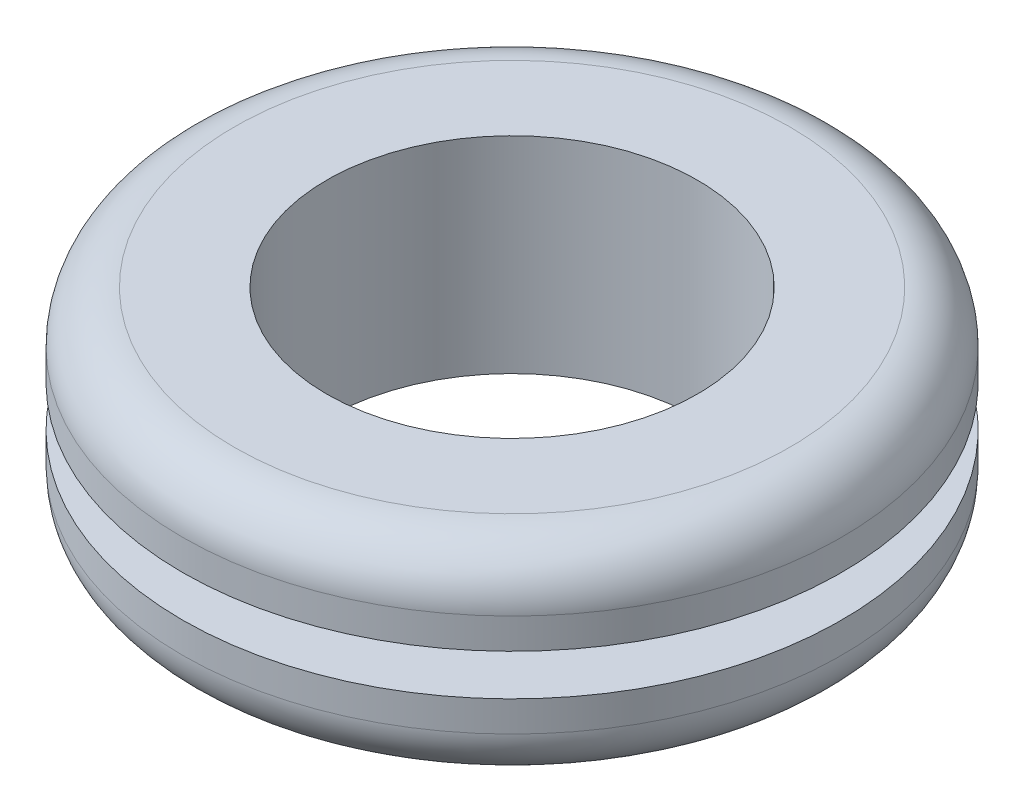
ISO-10303-21;
HEADER;
FILE_DESCRIPTION(('STEP AP214'),'2;1');
FILE_NAME('part.step','',(''),(''),'','','');
FILE_SCHEMA(('AUTOMOTIVE_DESIGN { 1 0 10303 214 1 1 1 1 }'));
ENDSEC;
DATA;
#1=APPLICATION_CONTEXT('core data for automotive mechanical design processes');
#2=APPLICATION_PROTOCOL_DEFINITION('international standard','automotive_design',2000,#1);
#3=PRODUCT_CONTEXT('',#1,'mechanical');
#4=PRODUCT('Part','Part','',(#3));
#5=PRODUCT_RELATED_PRODUCT_CATEGORY('part','',(#4));
#6=PRODUCT_DEFINITION_FORMATION('','',#4);
#7=PRODUCT_DEFINITION_CONTEXT('part definition',#1,'design');
#8=PRODUCT_DEFINITION('design','',#6,#7);
#9=PRODUCT_DEFINITION_SHAPE('','',#8);
#10=(LENGTH_UNIT() NAMED_UNIT(*) SI_UNIT(.MILLI.,.METRE.));
#11=(NAMED_UNIT(*) PLANE_ANGLE_UNIT() SI_UNIT($,.RADIAN.));
#12=(NAMED_UNIT(*) SI_UNIT($,.STERADIAN.) SOLID_ANGLE_UNIT());
#13=UNCERTAINTY_MEASURE_WITH_UNIT(LENGTH_MEASURE(1.E-05),#10,'distance_accuracy_value','');
#14=(GEOMETRIC_REPRESENTATION_CONTEXT(3) GLOBAL_UNCERTAINTY_ASSIGNED_CONTEXT((#13)) GLOBAL_UNIT_ASSIGNED_CONTEXT((#10,
#11,#12)) REPRESENTATION_CONTEXT('',''));
#15=CARTESIAN_POINT('',(0.,0.,0.));
#16=DIRECTION('',(0.,0.,1.));
#17=DIRECTION('',(1.,0.,0.));
#18=AXIS2_PLACEMENT_3D('',#15,#16,#17);
#19=CARTESIAN_POINT('',(-10.7,3.96874999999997,0.));
#20=DIRECTION('',(0.,1.,0.));
#21=DIRECTION('',(0.,0.,1.));
#22=AXIS2_PLACEMENT_3D('',#19,#20,#21);
#23=PLANE('',#22);
#24=CARTESIAN_POINT('',(0.,3.96874999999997,0.));
#25=DIRECTION('',(0.,1.,0.));
#26=DIRECTION('',(0.,0.,1.));
#27=AXIS2_PLACEMENT_3D('',#24,#25,#26);
#28=CIRCLE('',#27,7.14374999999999);
#29=CARTESIAN_POINT('',(0.,3.96874999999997,7.14374999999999));
#30=VERTEX_POINT('',#29);
#31=EDGE_CURVE('E52',#30,#30,#28,.F.);
#32=ORIENTED_EDGE('',*,*,#31,.T.);
#33=EDGE_LOOP('',(#32));
#34=FACE_BOUND('',#33,.T.);
#35=CARTESIAN_POINT('',(0.,3.96874999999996,0.));
#36=DIRECTION('',(0.,-1.,0.));
#37=DIRECTION('',(0.,0.,-1.));
#38=AXIS2_PLACEMENT_3D('',#35,#36,#37);
#39=CIRCLE('',#38,10.7);
#40=CARTESIAN_POINT('',(0.,3.96874999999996,-10.7));
#41=VERTEX_POINT('',#40);
#42=CARTESIAN_POINT('',(0.,3.96874999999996,10.7));
#43=VERTEX_POINT('',#42);
#44=EDGE_CURVE('E46',#41,#43,#39,.T.);
#45=ORIENTED_EDGE('',*,*,#44,.F.);
#46=CARTESIAN_POINT('',(0.,3.96874999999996,0.));
#47=DIRECTION('',(0.,-1.,0.));
#48=DIRECTION('',(0.,0.,1.));
#49=AXIS2_PLACEMENT_3D('',#46,#47,#48);
#50=CIRCLE('',#49,10.7);
#51=EDGE_CURVE('E50',#43,#41,#50,.T.);
#52=ORIENTED_EDGE('',*,*,#51,.F.);
#53=EDGE_LOOP('',(#45,#52));
#54=FACE_BOUND('',#53,.T.);
#55=ADVANCED_FACE('F17',(#34,#54),#23,.T.);
#56=CARTESIAN_POINT('',(0.,56.4422892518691,0.));
#57=DIRECTION('',(0.,1.,0.));
#58=DIRECTION('',(0.,0.,1.));
#59=AXIS2_PLACEMENT_3D('',#56,#57,#58);
#60=CYLINDRICAL_SURFACE('',#59,7.14374999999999);
#61=ORIENTED_EDGE('',*,*,#31,.F.);
#62=EDGE_LOOP('',(#61));
#63=FACE_BOUND('',#62,.T.);
#64=CARTESIAN_POINT('',(0.,-3.96874999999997,0.));
#65=DIRECTION('',(0.,1.,0.));
#66=DIRECTION('',(0.,0.,1.));
#67=AXIS2_PLACEMENT_3D('',#64,#65,#66);
#68=CIRCLE('',#67,7.14374999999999);
#69=CARTESIAN_POINT('',(0.,-3.96874999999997,7.14374999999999));
#70=VERTEX_POINT('',#69);
#71=EDGE_CURVE('E57',#70,#70,#68,.T.);
#72=ORIENTED_EDGE('',*,*,#71,.F.);
#73=EDGE_LOOP('',(#72));
#74=FACE_BOUND('',#73,.T.);
#75=ADVANCED_FACE('F75',(#63,#74),#60,.F.);
#76=CARTESIAN_POINT('',(0.,1.96874999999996,0.));
#77=DIRECTION('',(0.,1.,0.));
#78=DIRECTION('',(0.,0.,1.));
#79=AXIS2_PLACEMENT_3D('',#76,#77,#78);
#80=TOROIDAL_SURFACE('',#79,10.7,2.);
#81=CARTESIAN_POINT('',(0.,1.96874999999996,0.));
#82=DIRECTION('',(0.,1.,0.));
#83=DIRECTION('',(0.,0.,1.));
#84=AXIS2_PLACEMENT_3D('',#81,#82,#83);
#85=CIRCLE('',#84,12.7);
#86=CARTESIAN_POINT('',(0.,1.96874999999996,12.7));
#87=VERTEX_POINT('',#86);
#88=EDGE_CURVE('E86',#87,#87,#85,.F.);
#89=ORIENTED_EDGE('',*,*,#88,.F.);
#90=EDGE_LOOP('',(#89));
#91=FACE_BOUND('',#90,.T.);
#92=ORIENTED_EDGE('',*,*,#51,.T.);
#93=ORIENTED_EDGE('',*,*,#44,.T.);
#94=EDGE_LOOP('',(#92,#93));
#95=FACE_BOUND('',#94,.T.);
#96=ADVANCED_FACE('F56',(#91,#95),#80,.T.);
#97=CARTESIAN_POINT('',(-10.7,-3.96874999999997,0.));
#98=DIRECTION('',(0.,-1.,0.));
#99=DIRECTION('',(0.,0.,-1.));
#100=AXIS2_PLACEMENT_3D('',#97,#98,#99);
#101=PLANE('',#100);
#102=CARTESIAN_POINT('',(0.,-3.96874999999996,0.));
#103=DIRECTION('',(0.,1.,0.));
#104=DIRECTION('',(0.,0.,1.));
#105=AXIS2_PLACEMENT_3D('',#102,#103,#104);
#106=CIRCLE('',#105,10.7);
#107=CARTESIAN_POINT('',(0.,-3.96874999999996,10.7));
#108=VERTEX_POINT('',#107);
#109=CARTESIAN_POINT('',(0.,-3.96874999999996,-10.7));
#110=VERTEX_POINT('',#109);
#111=EDGE_CURVE('E37',#108,#110,#106,.T.);
#112=ORIENTED_EDGE('',*,*,#111,.F.);
#113=CARTESIAN_POINT('',(0.,-3.96874999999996,0.));
#114=DIRECTION('',(0.,1.,0.));
#115=DIRECTION('',(0.,0.,-1.));
#116=AXIS2_PLACEMENT_3D('',#113,#114,#115);
#117=CIRCLE('',#116,10.7);
#118=EDGE_CURVE('E90',#110,#108,#117,.T.);
#119=ORIENTED_EDGE('',*,*,#118,.F.);
#120=EDGE_LOOP('',(#112,#119));
#121=FACE_BOUND('',#120,.T.);
#122=ORIENTED_EDGE('',*,*,#71,.T.);
#123=EDGE_LOOP('',(#122));
#124=FACE_BOUND('',#123,.T.);
#125=ADVANCED_FACE('F74',(#121,#124),#101,.T.);
#126=CARTESIAN_POINT('',(0.,56.4422892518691,0.));
#127=DIRECTION('',(0.,1.,0.));
#128=DIRECTION('',(0.,0.,1.));
#129=AXIS2_PLACEMENT_3D('',#126,#127,#128);
#130=CYLINDRICAL_SURFACE('',#129,12.7);
#131=CARTESIAN_POINT('',(0.,0.793750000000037,0.));
#132=DIRECTION('',(0.,1.,0.));
#133=DIRECTION('',(0.,0.,1.));
#134=AXIS2_PLACEMENT_3D('',#131,#132,#133);
#135=CIRCLE('',#134,12.7);
#136=CARTESIAN_POINT('',(0.,0.793750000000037,12.7));
#137=VERTEX_POINT('',#136);
#138=EDGE_CURVE('E97',#137,#137,#135,.F.);
#139=ORIENTED_EDGE('',*,*,#138,.F.);
#140=EDGE_LOOP('',(#139));
#141=FACE_BOUND('',#140,.T.);
#142=ORIENTED_EDGE('',*,*,#88,.T.);
#143=EDGE_LOOP('',(#142));
#144=FACE_BOUND('',#143,.T.);
#145=ADVANCED_FACE('F116',(#141,#144),#130,.T.);
#146=CARTESIAN_POINT('',(0.,-1.96874999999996,0.));
#147=DIRECTION('',(0.,1.,0.));
#148=DIRECTION('',(0.,0.,1.));
#149=AXIS2_PLACEMENT_3D('',#146,#147,#148);
#150=TOROIDAL_SURFACE('',#149,10.7,2.);
#151=ORIENTED_EDGE('',*,*,#111,.T.);
#152=ORIENTED_EDGE('',*,*,#118,.T.);
#153=EDGE_LOOP('',(#151,#152));
#154=FACE_BOUND('',#153,.T.);
#155=CARTESIAN_POINT('',(0.,-1.96874999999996,0.));
#156=DIRECTION('',(0.,1.,0.));
#157=DIRECTION('',(0.,0.,1.));
#158=AXIS2_PLACEMENT_3D('',#155,#156,#157);
#159=CIRCLE('',#158,12.7);
#160=CARTESIAN_POINT('',(0.,-1.96874999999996,12.7));
#161=VERTEX_POINT('',#160);
#162=EDGE_CURVE('E121',#161,#161,#159,.T.);
#163=ORIENTED_EDGE('',*,*,#162,.F.);
#164=EDGE_LOOP('',(#163));
#165=FACE_BOUND('',#164,.T.);
#166=ADVANCED_FACE('F105',(#154,#165),#150,.T.);
#167=CARTESIAN_POINT('',(-9.525,0.793750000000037,0.));
#168=DIRECTION('',(0.,-1.,0.));
#169=DIRECTION('',(0.,0.,-1.));
#170=AXIS2_PLACEMENT_3D('',#167,#168,#169);
#171=PLANE('',#170);
#172=ORIENTED_EDGE('',*,*,#138,.T.);
#173=EDGE_LOOP('',(#172));
#174=FACE_BOUND('',#173,.T.);
#175=CARTESIAN_POINT('',(0.,0.793750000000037,0.));
#176=DIRECTION('',(0.,1.,0.));
#177=DIRECTION('',(0.,0.,1.));
#178=AXIS2_PLACEMENT_3D('',#175,#176,#177);
#179=CIRCLE('',#178,9.525);
#180=CARTESIAN_POINT('',(0.,0.793750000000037,9.525));
#181=VERTEX_POINT('',#180);
#182=EDGE_CURVE('E144',#181,#181,#179,.F.);
#183=ORIENTED_EDGE('',*,*,#182,.F.);
#184=EDGE_LOOP('',(#183));
#185=FACE_BOUND('',#184,.T.);
#186=ADVANCED_FACE('F115',(#174,#185),#171,.T.);
#187=CARTESIAN_POINT('',(0.,56.4422892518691,0.));
#188=DIRECTION('',(0.,1.,0.));
#189=DIRECTION('',(0.,0.,1.));
#190=AXIS2_PLACEMENT_3D('',#187,#188,#189);
#191=CYLINDRICAL_SURFACE('',#190,12.7);
#192=ORIENTED_EDGE('',*,*,#162,.T.);
#193=EDGE_LOOP('',(#192));
#194=FACE_BOUND('',#193,.T.);
#195=CARTESIAN_POINT('',(0.,-0.793750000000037,0.));
#196=DIRECTION('',(0.,1.,0.));
#197=DIRECTION('',(0.,0.,1.));
#198=AXIS2_PLACEMENT_3D('',#195,#196,#197);
#199=CIRCLE('',#198,12.7);
#200=CARTESIAN_POINT('',(0.,-0.793750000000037,12.7));
#201=VERTEX_POINT('',#200);
#202=EDGE_CURVE('E29',#201,#201,#199,.T.);
#203=ORIENTED_EDGE('',*,*,#202,.F.);
#204=EDGE_LOOP('',(#203));
#205=FACE_BOUND('',#204,.T.);
#206=ADVANCED_FACE('F155',(#194,#205),#191,.T.);
#207=CARTESIAN_POINT('',(0.,56.4422892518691,0.));
#208=DIRECTION('',(0.,1.,0.));
#209=DIRECTION('',(0.,0.,1.));
#210=AXIS2_PLACEMENT_3D('',#207,#208,#209);
#211=CYLINDRICAL_SURFACE('',#210,9.525);
#212=CARTESIAN_POINT('',(0.,-0.793750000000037,0.));
#213=DIRECTION('',(0.,1.,0.));
#214=DIRECTION('',(0.,0.,1.));
#215=AXIS2_PLACEMENT_3D('',#212,#213,#214);
#216=CIRCLE('',#215,9.525);
#217=CARTESIAN_POINT('',(0.,-0.793750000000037,9.525));
#218=VERTEX_POINT('',#217);
#219=EDGE_CURVE('E11',#218,#218,#216,.F.);
#220=ORIENTED_EDGE('',*,*,#219,.F.);
#221=EDGE_LOOP('',(#220));
#222=FACE_BOUND('',#221,.T.);
#223=ORIENTED_EDGE('',*,*,#182,.T.);
#224=EDGE_LOOP('',(#223));
#225=FACE_BOUND('',#224,.T.);
#226=ADVANCED_FACE('F157',(#222,#225),#211,.T.);
#227=CARTESIAN_POINT('',(-9.525,-0.793750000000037,0.));
#228=DIRECTION('',(0.,1.,0.));
#229=DIRECTION('',(0.,0.,1.));
#230=AXIS2_PLACEMENT_3D('',#227,#228,#229);
#231=PLANE('',#230);
#232=ORIENTED_EDGE('',*,*,#219,.T.);
#233=EDGE_LOOP('',(#232));
#234=FACE_BOUND('',#233,.T.);
#235=ORIENTED_EDGE('',*,*,#202,.T.);
#236=EDGE_LOOP('',(#235));
#237=FACE_BOUND('',#236,.T.);
#238=ADVANCED_FACE('F153',(#234,#237),#231,.T.);
#239=CLOSED_SHELL('',(#55,#75,#96,#125,#145,#166,#186,#206,#226,#238));
#240=MANIFOLD_SOLID_BREP('B1',#239);
#241=ADVANCED_BREP_SHAPE_REPRESENTATION('',(#18,#240),#14);
#242=SHAPE_DEFINITION_REPRESENTATION(#9,#241);
ENDSEC;
END-ISO-10303-21;
